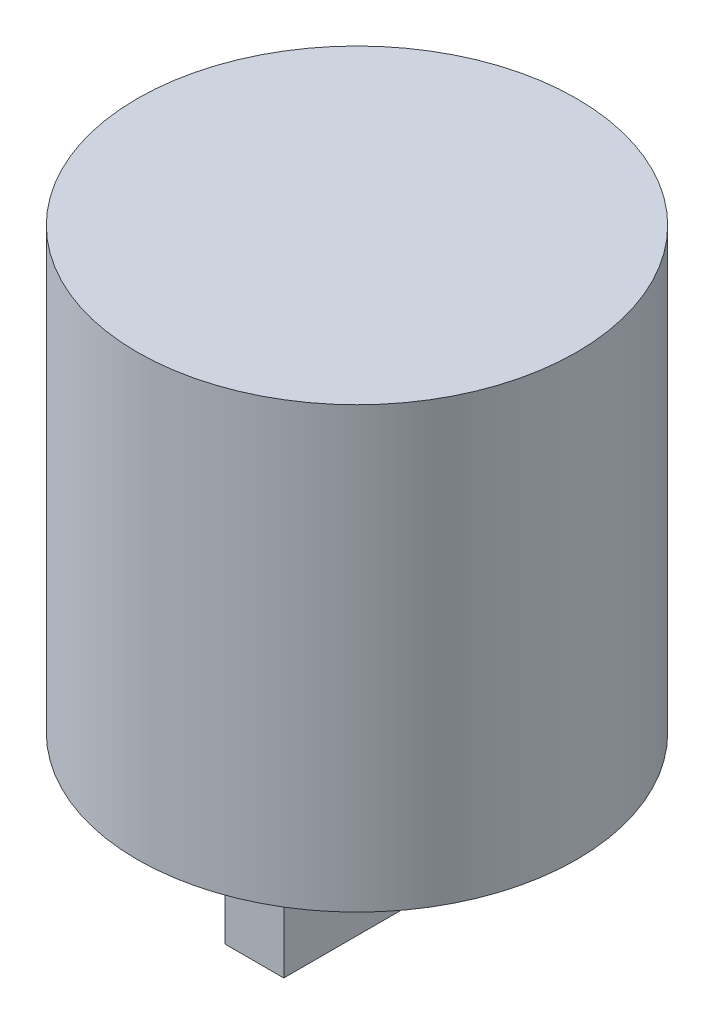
from build123d import *

# Parameters (mm, degrees)
SKETCH1_R                = 19.05
BOSS_EXTRUDE1_DEPTH      = 38.1
BOSS_EXTRUDE3_DEPTH      = 2.54
BOSS_EXTRUDE3_DEPTH_BACK = 2.54
SKETCH3_W                = 17.78
SKETCH3_H                = 12.7
SKETCH4_R                = 2.54
CUT_EXTRUDE1_DEPTH       = 48.756053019


with BuildPart() as part:
    # Sketch1 → Boss-Extrude1 (new body)
    with BuildSketch(Plane(origin=(0, 0, 0), x_dir=(1, 0, 0), z_dir=(0, 1, 0))):
        with Locations(Location((0, 0, 0), (0, 0, 90))):
            Circle(SKETCH1_R)
    extrude(amount=BOSS_EXTRUDE1_DEPTH)

    # Sketch3 → Boss-Extrude3 (add, two sides: drawn at the far end of the back side and taken through both)
    with BuildSketch(Plane(origin=(0, 0, 0), x_dir=(0, 0, -1), z_dir=(1, 0, 0)).offset(-BOSS_EXTRUDE3_DEPTH_BACK)):
        with Locations((0, -6.35)):
            Rectangle(SKETCH3_W, SKETCH3_H)
    extrude(amount=BOSS_EXTRUDE3_DEPTH + BOSS_EXTRUDE3_DEPTH_BACK)

    # Sketch4 → Cut-Extrude1 (cut, through all)
    with BuildSketch(Plane.ZY.offset(2.54)):
        with Locations((0, -7.62)):
            Circle(SKETCH4_R)
    extrude(amount=-CUT_EXTRUDE1_DEPTH, mode=Mode.SUBTRACT)


solid = part.part
